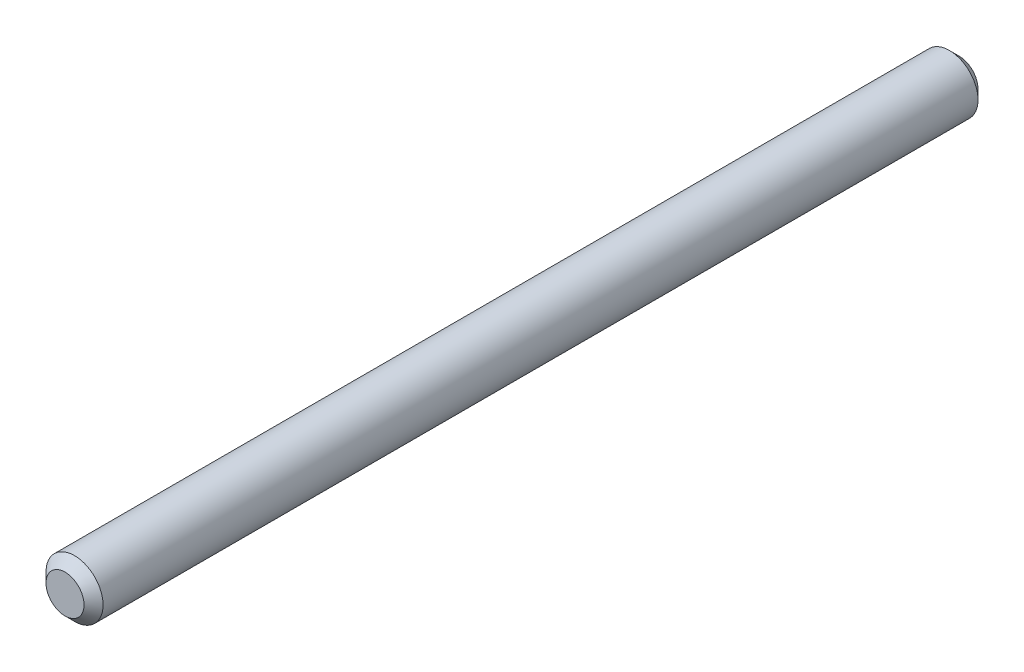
ISO-10303-21;
HEADER;
FILE_DESCRIPTION(('STEP AP214'),'2;1');
FILE_NAME('part.step','',(''),(''),'','','');
FILE_SCHEMA(('AUTOMOTIVE_DESIGN { 1 0 10303 214 1 1 1 1 }'));
ENDSEC;
DATA;
#1=APPLICATION_CONTEXT('core data for automotive mechanical design processes');
#2=APPLICATION_PROTOCOL_DEFINITION('international standard','automotive_design',2000,#1);
#3=PRODUCT_CONTEXT('',#1,'mechanical');
#4=PRODUCT('Part','Part','',(#3));
#5=PRODUCT_RELATED_PRODUCT_CATEGORY('part','',(#4));
#6=PRODUCT_DEFINITION_FORMATION('','',#4);
#7=PRODUCT_DEFINITION_CONTEXT('part definition',#1,'design');
#8=PRODUCT_DEFINITION('design','',#6,#7);
#9=PRODUCT_DEFINITION_SHAPE('','',#8);
#10=(LENGTH_UNIT() NAMED_UNIT(*) SI_UNIT(.MILLI.,.METRE.));
#11=(NAMED_UNIT(*) PLANE_ANGLE_UNIT() SI_UNIT($,.RADIAN.));
#12=(NAMED_UNIT(*) SI_UNIT($,.STERADIAN.) SOLID_ANGLE_UNIT());
#13=UNCERTAINTY_MEASURE_WITH_UNIT(LENGTH_MEASURE(1.E-05),#10,'distance_accuracy_value','');
#14=(GEOMETRIC_REPRESENTATION_CONTEXT(3) GLOBAL_UNCERTAINTY_ASSIGNED_CONTEXT((#13)) GLOBAL_UNIT_ASSIGNED_CONTEXT((#10,
#11,#12)) REPRESENTATION_CONTEXT('',''));
#15=CARTESIAN_POINT('',(0.,0.,0.));
#16=DIRECTION('',(0.,0.,1.));
#17=DIRECTION('',(1.,0.,0.));
#18=AXIS2_PLACEMENT_3D('',#15,#16,#17);
#19=CARTESIAN_POINT('',(0.,0.,47.));
#20=DIRECTION('',(0.,0.,-1.));
#21=DIRECTION('',(-1.,0.,0.));
#22=AXIS2_PLACEMENT_3D('',#19,#20,#21);
#23=CYLINDRICAL_SURFACE('',#22,1.5);
#24=CARTESIAN_POINT('',(0.,0.,0.499999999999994));
#25=DIRECTION('',(0.,0.,1.));
#26=DIRECTION('',(1.,0.,0.));
#27=AXIS2_PLACEMENT_3D('',#24,#25,#26);
#28=CIRCLE('',#27,1.5);
#29=CARTESIAN_POINT('',(1.5,0.,0.499999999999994));
#30=VERTEX_POINT('',#29);
#31=EDGE_CURVE('E42',#30,#30,#28,.T.);
#32=ORIENTED_EDGE('',*,*,#31,.T.);
#33=EDGE_LOOP('',(#32));
#34=FACE_BOUND('',#33,.T.);
#35=CARTESIAN_POINT('',(0.,0.,46.5));
#36=DIRECTION('',(0.,0.,1.));
#37=DIRECTION('',(1.,0.,0.));
#38=AXIS2_PLACEMENT_3D('',#35,#36,#37);
#39=CIRCLE('',#38,1.5);
#40=CARTESIAN_POINT('',(1.5,0.,46.5));
#41=VERTEX_POINT('',#40);
#42=EDGE_CURVE('E46',#41,#41,#39,.F.);
#43=ORIENTED_EDGE('',*,*,#42,.T.);
#44=EDGE_LOOP('',(#43));
#45=FACE_BOUND('',#44,.T.);
#46=ADVANCED_FACE('F31',(#34,#45),#23,.T.);
#47=CARTESIAN_POINT('',(0.,0.,47.));
#48=DIRECTION('',(0.,0.,1.));
#49=DIRECTION('',(1.,0.,0.));
#50=AXIS2_PLACEMENT_3D('',#47,#48,#49);
#51=PLANE('',#50);
#52=CARTESIAN_POINT('',(0.,0.,47.));
#53=DIRECTION('',(0.,0.,1.));
#54=DIRECTION('',(1.,0.,0.));
#55=AXIS2_PLACEMENT_3D('',#52,#53,#54);
#56=CIRCLE('',#55,1.);
#57=CARTESIAN_POINT('',(1.,0.,47.));
#58=VERTEX_POINT('',#57);
#59=EDGE_CURVE('E10',#58,#58,#56,.T.);
#60=ORIENTED_EDGE('',*,*,#59,.T.);
#61=EDGE_LOOP('',(#60));
#62=FACE_BOUND('',#61,.T.);
#63=ADVANCED_FACE('F62',(#62),#51,.T.);
#64=CARTESIAN_POINT('',(0.,0.,0.));
#65=DIRECTION('',(0.,0.,1.));
#66=DIRECTION('',(1.,0.,0.));
#67=AXIS2_PLACEMENT_3D('',#64,#65,#66);
#68=PLANE('',#67);
#69=CARTESIAN_POINT('',(0.,0.,0.));
#70=DIRECTION('',(0.,0.,1.));
#71=DIRECTION('',(1.,0.,0.));
#72=AXIS2_PLACEMENT_3D('',#69,#70,#71);
#73=CIRCLE('',#72,1.);
#74=CARTESIAN_POINT('',(1.,0.,0.));
#75=VERTEX_POINT('',#74);
#76=EDGE_CURVE('E38',#75,#75,#73,.F.);
#77=ORIENTED_EDGE('',*,*,#76,.T.);
#78=EDGE_LOOP('',(#77));
#79=FACE_BOUND('',#78,.T.);
#80=ADVANCED_FACE('F59',(#79),#68,.F.);
#81=CARTESIAN_POINT('',(0.,0.,0.499999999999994));
#82=DIRECTION('',(0.,0.,1.));
#83=DIRECTION('',(1.,0.,0.));
#84=AXIS2_PLACEMENT_3D('',#81,#82,#83);
#85=CONICAL_SURFACE('',#84,1.5,0.785398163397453);
#86=ORIENTED_EDGE('',*,*,#76,.F.);
#87=EDGE_LOOP('',(#86));
#88=FACE_BOUND('',#87,.T.);
#89=ORIENTED_EDGE('',*,*,#31,.F.);
#90=EDGE_LOOP('',(#89));
#91=FACE_BOUND('',#90,.T.);
#92=ADVANCED_FACE('F55',(#88,#91),#85,.T.);
#93=CARTESIAN_POINT('',(0.,0.,47.));
#94=DIRECTION('',(0.,0.,-1.));
#95=DIRECTION('',(-1.,0.,0.));
#96=AXIS2_PLACEMENT_3D('',#93,#94,#95);
#97=CONICAL_SURFACE('',#96,1.,0.785398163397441);
#98=ORIENTED_EDGE('',*,*,#42,.F.);
#99=EDGE_LOOP('',(#98));
#100=FACE_BOUND('',#99,.T.);
#101=ORIENTED_EDGE('',*,*,#59,.F.);
#102=EDGE_LOOP('',(#101));
#103=FACE_BOUND('',#102,.T.);
#104=ADVANCED_FACE('F33',(#100,#103),#97,.T.);
#105=CLOSED_SHELL('',(#46,#63,#80,#92,#104));
#106=MANIFOLD_SOLID_BREP('B2',#105);
#107=ADVANCED_BREP_SHAPE_REPRESENTATION('',(#18,#106),#14);
#108=SHAPE_DEFINITION_REPRESENTATION(#9,#107);
ENDSEC;
END-ISO-10303-21;
